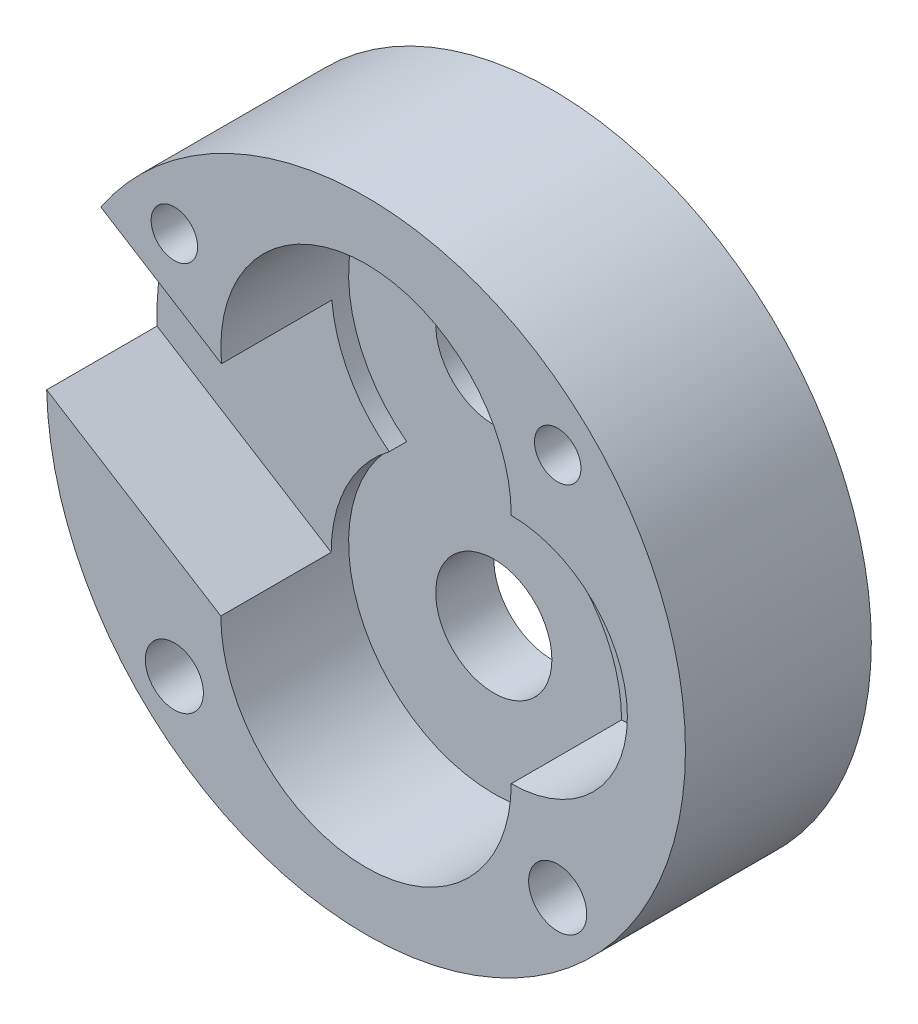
from build123d import *

# Parameters (mm, degrees)
SKETCH1_R           = 55
BOSS_EXTRUDE1_DEPTH = 32
SKETCH1_19_R        = 10
CUT_EXTRUDE1_DEPTH  = 22
CUT_EXTRUDE2_DEPTH  = 19
SKETCH1_21_R        = 10
SKETCH1_21_R_2      = 4
SKETCH1_21_R_3      = 5
CUT_EXTRUDE3_DEPTH  = 85.107074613


with BuildPart() as part:
    # Sketch1 → Boss-Extrude1 (new body)
    with BuildSketch(Plane.XY):
        Circle(SKETCH1_R)
    extrude(amount=-BOSS_EXTRUDE1_DEPTH)

    # Sketch1_19 → Cut-Extrude1 (cut)
    # profile 1 of 3: a face of its own
    with BuildSketch(Plane.XY):
        with BuildLine():
            ThreePointArc((15, 0), (0, 45), (-15, 0))
            ThreePointArc((-15, 0), (0, -45), (15, 0))
        make_face()
        with Locations((0, -20)):
            Circle(SKETCH1_19_R, mode=Mode.SUBTRACT)
        with Locations((0, 20)):
            Circle(SKETCH1_19_R, mode=Mode.SUBTRACT)
    # profile 2 of 3: a face of its own
    with BuildSketch(Plane.XY):
        with Locations((0, -20)):
            Circle(SKETCH1_19_R)
    # profile 3 of 3: a face of its own
    with BuildSketch(Plane.XY):
        with Locations((0, 20)):
            Circle(SKETCH1_19_R)
    extrude(amount=-CUT_EXTRUDE1_DEPTH, mode=Mode.SUBTRACT)

    # Sketch1_20 → Cut-Extrude2 (cut)
    with BuildSketch(Plane.XY):
        with BuildLine():
            ThreePointArc((-45.668792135, 30.649003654), (-52.795976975, 15.41378653), (-54.985496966, -1.262981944))
            Line((-54.985496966, -1.262981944), (-25, -20))
            ThreePointArc((-25, -20), (-22.360679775, -8.819660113), (-15, 0))
            ThreePointArc((-15, 0), (-21.813646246, 7.786694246), (-24.890758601, 17.665447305))
            Line((-24.890758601, 17.665447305), (-45.668792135, 30.649003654))
        make_face()
        with BuildLine():
            ThreePointArc((15, 0), (22.360679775, -8.819660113), (25, -20))
            ThreePointArc((25, -20), (45, 0), (25, 20))
            ThreePointArc((25, 20), (22.360679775, 8.819660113), (15, 0))
        make_face()
    extrude(amount=-CUT_EXTRUDE2_DEPTH, mode=Mode.SUBTRACT)

    # Sketch1_21 → Cut-Extrude3 (cut, through all)
    with BuildSketch(Plane.XY):
        with Locations((0, 20)):
            Circle(SKETCH1_21_R)
        with Locations((0, -20)):
            Circle(SKETCH1_21_R)
        with Locations((-33, 33)):
            Circle(SKETCH1_21_R_2)
        with Locations((33, 33)):
            Circle(SKETCH1_21_R_2)
        with Locations((33, -33)):
            Circle(SKETCH1_21_R_3)
        with Locations((-33, -33)):
            Circle(SKETCH1_21_R_3)
    extrude(amount=-CUT_EXTRUDE3_DEPTH, mode=Mode.SUBTRACT)


solid = part.part
